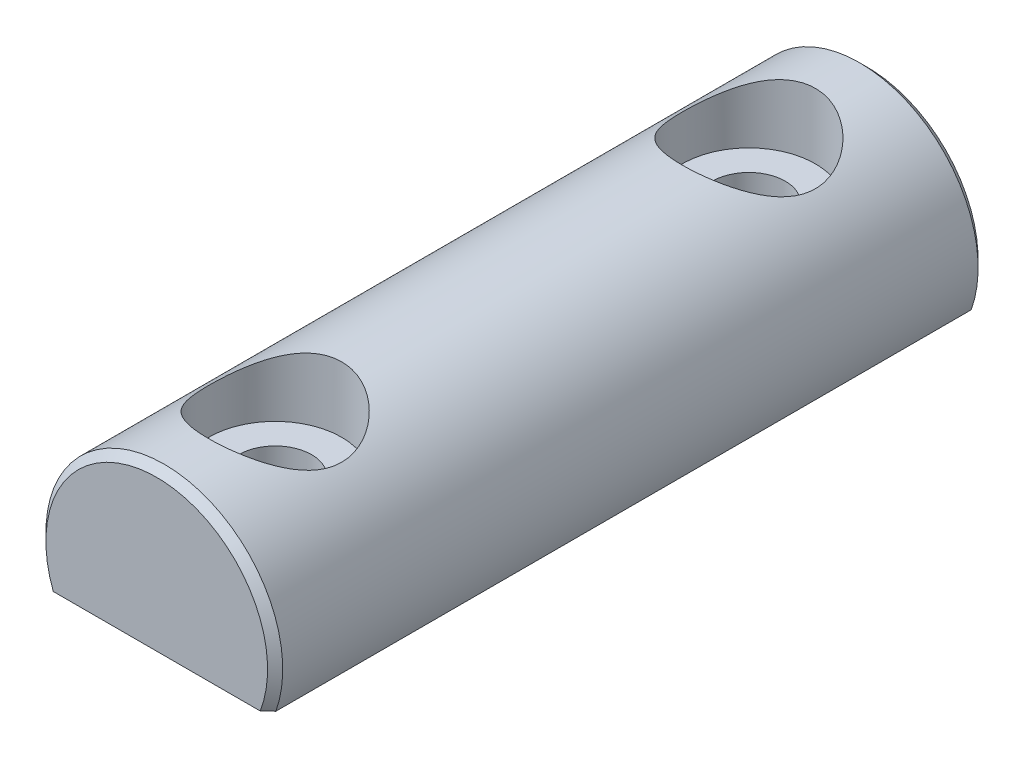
from build123d import *

# Parameters (mm, degrees)
SKETCH1_R            = 6.35
EXTRUDE1_DEPTH       = 19.05
CHAMFER1_SIZE        = 0.4064
TRUNCATED_DEPTH      = 22.060567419
TRUNCATED_DEPTH_BACK = 22.060567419
RECESSED_DEPTH       = 0.127


with BuildPart() as part:
    # Sketch1 → Extrude1 (new, symmetric)
    with BuildSketch(Plane.XY):
        with Locations(Location((0, 0, 0), (0, 0, 180))):
            Circle(SKETCH1_R)
    extrude(amount=EXTRUDE1_DEPTH, both=True)

    # Chamfer1
    chamfer1_edges = [part.edges().sort_by_distance(p)[0] for p in [
        (6.35, 0, -19.05),
        (6.35, 0, 19.05),
    ]]
    chamfer(chamfer1_edges, length=CHAMFER1_SIZE)

    # Sketch2 → Truncated (cut, two sides: drawn at the far end of the back side and taken through both)
    with BuildSketch(Plane.XY.offset(-TRUNCATED_DEPTH_BACK)):
        with BuildLine():
            Line((-5.980823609, -2.1336), (5.980823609, -2.1336))
            ThreePointArc((5.980823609, -2.1336), (0, -6.35), (-5.980823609, -2.1336))
        make_face()
    extrude(amount=TRUNCATED_DEPTH + TRUNCATED_DEPTH_BACK, mode=Mode.SUBTRACT)

    # Sketch3 → Recessed (cut)
    with BuildSketch(Plane.XZ.offset(2.1336)):
        with BuildLine():
            Line((3.885323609, 17.4625), (-3.885323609, 17.4625))
            ThreePointArc((-3.885323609, 17.4625), (-4.244533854, 17.313710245), (-4.393323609, 16.9545))
            Line((-4.393323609, 16.9545), (-4.393323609, -16.9545))
            ThreePointArc((-4.393323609, -16.9545), (-4.244533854, -17.313710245), (-3.885323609, -17.4625))
            Line((-3.885323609, -17.4625), (3.885323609, -17.4625))
            ThreePointArc((3.885323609, -17.4625), (4.244533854, -17.313710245), (4.393323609, -16.9545))
            Line((4.393323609, -16.9545), (4.393323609, 16.9545))
            ThreePointArc((4.393323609, 16.9545), (4.244533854, 17.313710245), (3.885323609, 17.4625))
        make_face()
    extrude(amount=-RECESSED_DEPTH, mode=Mode.SUBTRACT)

    # Sketch5 → CtBored Hole Cut-Revolve1 (revolve, cut)
    with BuildSketch(Plane(origin=(0, 0, 0), x_dir=(0, 0, -1), z_dir=(1, 0, 0)), mode=Mode.PRIVATE) as ctbored_hole_cut_revolve1_sk:
        Polygon((14.6558, -6.35), (14.6558, 2.8448), (16.2687, 2.8448), (16.2687, 6.35), (12.7, 6.35), (12.7, -6.35), align=None)
    ctbored_hole_cut_revolve1 = revolve(ctbored_hole_cut_revolve1_sk.sketch.rotate(Axis((0, 11.226654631, -12.7), (0, -1, 0)), 180), axis=Axis((0, 11.226654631, -12.7), (0, -1, 0)), mode=Mode.SUBTRACT)

    # CtBored Hole Mirror1: CtBored Hole Cut-Revolve1 across plane
    add(ctbored_hole_cut_revolve1.mirror(Plane.XY), mode=Mode.SUBTRACT)


solid = part.part
